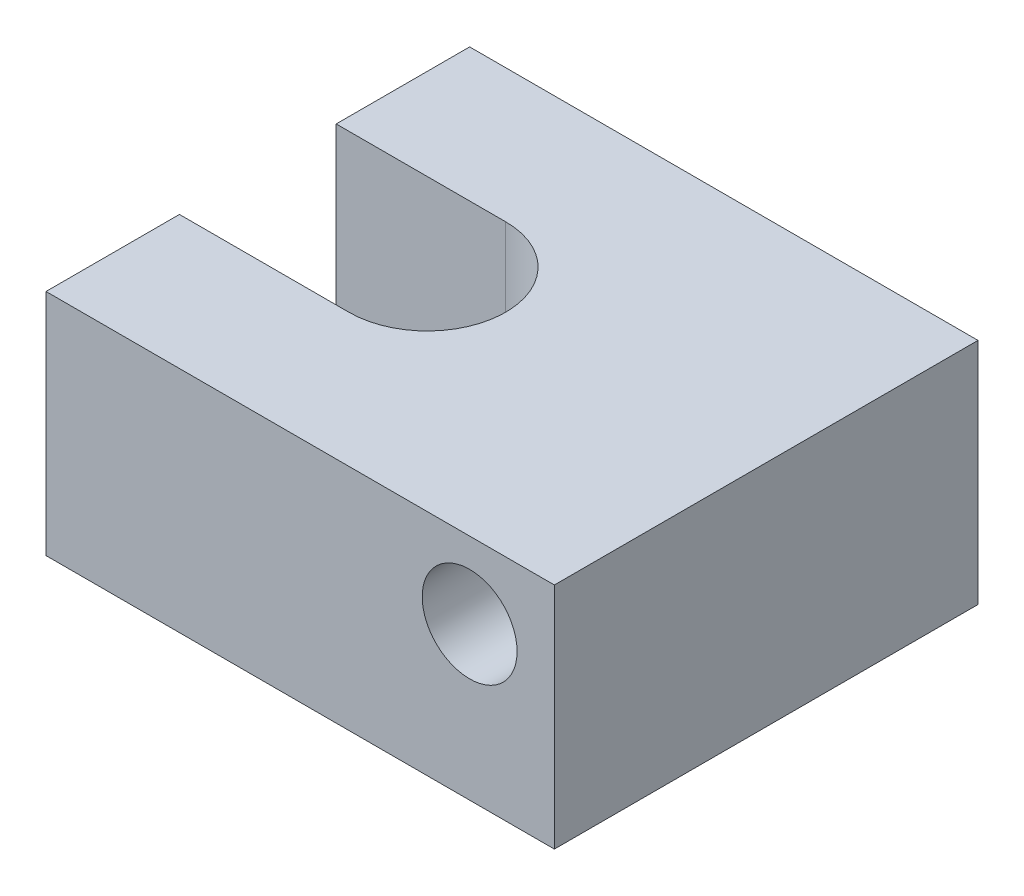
from build123d import *

# Parameters (mm, degrees)
SKETCH1_W                       = 15.24
SKETCH1_H                       = 6.858
BASE_EXTRUDE_DEPTH              = 12.7
F_4_40_TAPPED_HOLE1_D           = 2.2606
F_4_40_TAPPED_HOLE1_DEPTH       = 12.7
F_4_40_TAPPED_HOLE1_CBORE_D     = 2.8448
F_4_40_TAPPED_HOLE1_CBORE_DEPTH = 5.6900064
F_4_40_TAPPED_HOLE1_TIP         = 0.679152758
CUT_EXTRUDE2_DEPTH              = 17.321353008


with BuildPart() as part:
    # Sketch1 → Base-Extrude (new body)
    with BuildSketch(Plane.XY):
        Rectangle(SKETCH1_W, SKETCH1_H)
    extrude(amount=-BASE_EXTRUDE_DEPTH)

    # 4-40 Tapped Hole1
    with Locations(Plane.XY):
        with Locations((5.08, 1.143)):
            CounterBoreHole(F_4_40_TAPPED_HOLE1_D / 2, F_4_40_TAPPED_HOLE1_CBORE_D / 2, F_4_40_TAPPED_HOLE1_CBORE_DEPTH, depth=F_4_40_TAPPED_HOLE1_DEPTH)
            with Locations((0, 0, -(F_4_40_TAPPED_HOLE1_DEPTH + F_4_40_TAPPED_HOLE1_TIP / 2))):  # 118° drill point
                Cone(0, F_4_40_TAPPED_HOLE1_D / 2, F_4_40_TAPPED_HOLE1_TIP, mode=Mode.SUBTRACT)

    # Sketch5 → Cut-Extrude2 (cut, through all)
    with BuildSketch(Plane(origin=(0, 3.429, 0), x_dir=(-1, 0, 0), z_dir=(0, 1, 0))):
        with BuildLine():
            Line((2.54, -4.0005), (7.62, -4.0005))
            Line((7.62, -4.0005), (7.62, -8.6995))
            Line((7.62, -8.6995), (2.54, -8.6995))
            ThreePointArc((2.54, -8.6995), (0.1905, -6.35), (2.54, -4.0005))
        make_face()
    extrude(amount=-CUT_EXTRUDE2_DEPTH, mode=Mode.SUBTRACT)


solid = part.part
